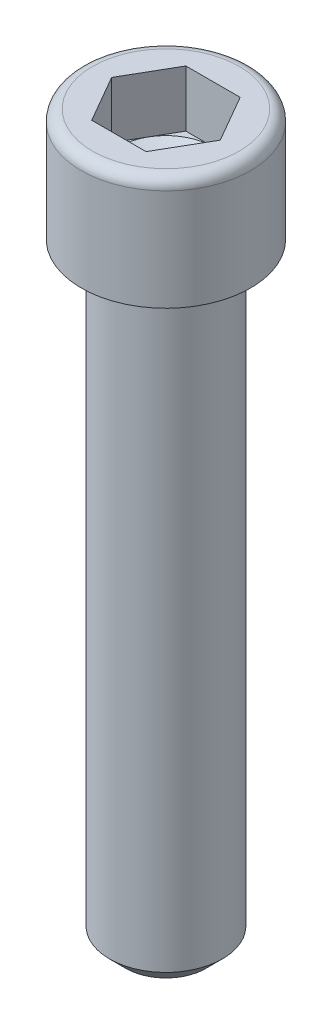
from build123d import *

# Parameters (mm, degrees)
TIGE_START              = -65
ESQUISSE1_R             = 6
TIGE_DEPTH              = 65
CHANFREIN_D_ENTR_E_SIZE = 1.75
HEXAGONE_DEPTH          = 6


with BuildPart() as part:
    # Esquisse1 → Tige (new body)
    with BuildSketch(Plane(origin=(0, 0, 0), x_dir=(1, 0, 0), z_dir=(0, 1, 0)).offset(TIGE_START)):
        with Locations(Location((0, 0, 0), (0, 0, 270))):
            Circle(ESQUISSE1_R)
    extrude(amount=TIGE_DEPTH)

    # Chanfrein d_entr_e
    chanfrein_d_entr_e_edges = [part.edges().sort_by_distance(p)[0] for p in [
        (0, -65, -6),
    ]]
    chamfer(chanfrein_d_entr_e_edges, length=CHANFREIN_D_ENTR_E_SIZE)

    # Esquisse2 → T_te (revolve)
    with BuildSketch(Plane.XY, mode=Mode.PRIVATE) as t_te_sk:
        with BuildLine():
            Line((5, 12), (5, 6))
            Line((5, 6), (0, 3.113248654))
            Line((0, 3.113248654), (0, 0))
            Line((0, 0), (9, 0))
            Line((9, 0), (9, 10.8))
            ThreePointArc((9, 10.8), (8.648528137, 11.648528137), (7.8, 12))
            Line((7.8, 12), (5, 12))
        make_face()
    revolve(t_te_sk.sketch.rotate(Axis((0, 12, 0), (0, -1, 0)), 180), axis=Axis((0, 12, 0), (0, -1, 0)))

    # Esquisse3 → Hexagone (cut)
    with BuildSketch(Plane(origin=(0, 12, -3), x_dir=(1, 0, 0), z_dir=(0, -1, 0))):
        Polygon((2.886751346, 8), (-2.886751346, 8), (-5.773502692, 3), (-2.886751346, -2), (2.886751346, -2), (5.773502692, 3), align=None)
    extrude(amount=HEXAGONE_DEPTH, mode=Mode.SUBTRACT)


solid = part.part
